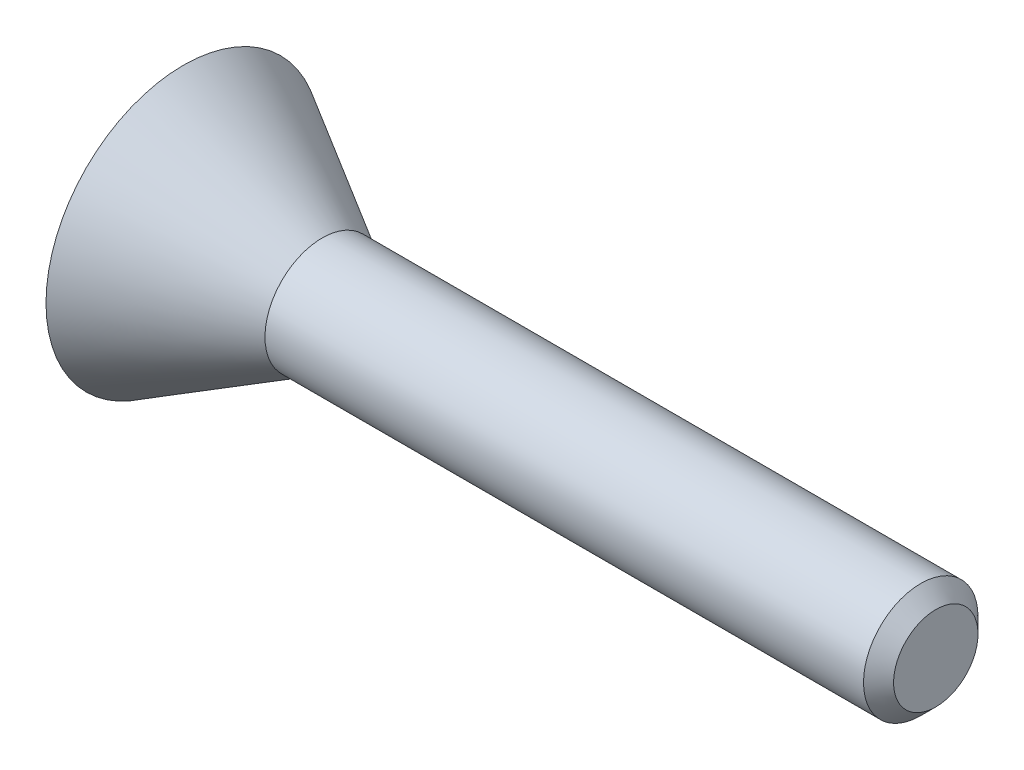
ISO-10303-21;
HEADER;
FILE_DESCRIPTION(('STEP AP214'),'2;1');
FILE_NAME('part.step','',(''),(''),'','','');
FILE_SCHEMA(('AUTOMOTIVE_DESIGN { 1 0 10303 214 1 1 1 1 }'));
ENDSEC;
DATA;
#1=APPLICATION_CONTEXT('core data for automotive mechanical design processes');
#2=APPLICATION_PROTOCOL_DEFINITION('international standard','automotive_design',2000,#1);
#3=PRODUCT_CONTEXT('',#1,'mechanical');
#4=PRODUCT('Part','Part','',(#3));
#5=PRODUCT_RELATED_PRODUCT_CATEGORY('part','',(#4));
#6=PRODUCT_DEFINITION_FORMATION('','',#4);
#7=PRODUCT_DEFINITION_CONTEXT('part definition',#1,'design');
#8=PRODUCT_DEFINITION('design','',#6,#7);
#9=PRODUCT_DEFINITION_SHAPE('','',#8);
#10=(LENGTH_UNIT() NAMED_UNIT(*) SI_UNIT(.MILLI.,.METRE.));
#11=(NAMED_UNIT(*) PLANE_ANGLE_UNIT() SI_UNIT($,.RADIAN.));
#12=(NAMED_UNIT(*) SI_UNIT($,.STERADIAN.) SOLID_ANGLE_UNIT());
#13=UNCERTAINTY_MEASURE_WITH_UNIT(LENGTH_MEASURE(1.E-05),#10,'distance_accuracy_value','');
#14=(GEOMETRIC_REPRESENTATION_CONTEXT(3) GLOBAL_UNCERTAINTY_ASSIGNED_CONTEXT((#13)) GLOBAL_UNIT_ASSIGNED_CONTEXT((#10,
#11,#12)) REPRESENTATION_CONTEXT('',''));
#15=CARTESIAN_POINT('',(0.,0.,0.));
#16=DIRECTION('',(0.,0.,1.));
#17=DIRECTION('',(1.,0.,0.));
#18=AXIS2_PLACEMENT_3D('',#15,#16,#17);
#19=CARTESIAN_POINT('',(-11.5,0.,0.));
#20=DIRECTION('',(1.,0.,0.));
#21=DIRECTION('',(0.,0.,-1.));
#22=AXIS2_PLACEMENT_3D('',#19,#20,#21);
#23=PLANE('',#22);
#24=DIRECTION('',(0.,-1.,0.));
#25=VECTOR('',#24,1.);
#26=CARTESIAN_POINT('',(-11.5,1.08953627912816,-2.69172329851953));
#27=LINE('',#26,#25);
#28=CARTESIAN_POINT('',(-11.5,1.08953627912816,-2.69172329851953));
#29=VERTEX_POINT('',#28);
#30=CARTESIAN_POINT('',(-11.5,0.725859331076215,-2.69172329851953));
#31=VERTEX_POINT('',#30);
#32=EDGE_CURVE('E298',#29,#31,#27,.T.);
#33=ORIENTED_EDGE('',*,*,#32,.F.);
#34=DIRECTION('',(0.,0.,-1.));
#35=VECTOR('',#34,1.);
#36=CARTESIAN_POINT('',(-11.5,1.08953627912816,-1.04164212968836));
#37=LINE('',#36,#35);
#38=CARTESIAN_POINT('',(-11.5,1.08953627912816,-1.04164212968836));
#39=VERTEX_POINT('',#38);
#40=EDGE_CURVE('E54',#39,#29,#37,.T.);
#41=ORIENTED_EDGE('',*,*,#40,.F.);
#42=DIRECTION('',(0.,1.,0.));
#43=VECTOR('',#42,1.);
#44=CARTESIAN_POINT('',(-11.5,0.110315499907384,-1.04164212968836));
#45=LINE('',#44,#43);
#46=CARTESIAN_POINT('',(-11.5,0.110315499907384,-1.04164212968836));
#47=VERTEX_POINT('',#46);
#48=EDGE_CURVE('E275',#47,#39,#45,.T.);
#49=ORIENTED_EDGE('',*,*,#48,.F.);
#50=DIRECTION('',(0.,0.,1.));
#51=VECTOR('',#50,1.);
#52=CARTESIAN_POINT('',(-11.5,0.110315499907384,-1.58598060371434));
#53=LINE('',#52,#51);
#54=CARTESIAN_POINT('',(-11.5,0.110315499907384,-1.58598060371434));
#55=VERTEX_POINT('',#54);
#56=EDGE_CURVE('E278',#55,#47,#53,.T.);
#57=ORIENTED_EDGE('',*,*,#56,.F.);
#58=DIRECTION('',(0.,-1.,0.));
#59=VECTOR('',#58,1.);
#60=CARTESIAN_POINT('',(-11.5,0.562263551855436,-1.58598060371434));
#61=LINE('',#60,#59);
#62=CARTESIAN_POINT('',(-11.5,0.562263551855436,-1.58598060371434));
#63=VERTEX_POINT('',#62);
#64=EDGE_CURVE('E312',#63,#55,#61,.T.);
#65=ORIENTED_EDGE('',*,*,#64,.F.);
#66=DIRECTION('',(0.,0.,1.));
#67=VECTOR('',#66,1.);
#68=CARTESIAN_POINT('',(-11.5,0.562263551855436,-2.08206420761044));
#69=LINE('',#68,#67);
#70=CARTESIAN_POINT('',(-11.5,0.562263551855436,-2.08206420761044));
#71=VERTEX_POINT('',#70);
#72=EDGE_CURVE('E309',#71,#63,#69,.T.);
#73=ORIENTED_EDGE('',*,*,#72,.F.);
#74=DIRECTION('',(0.,0.966781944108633,-0.255602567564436));
#75=VECTOR('',#74,1.);
#76=CARTESIAN_POINT('',(-11.5,-1.81046372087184,-1.45475089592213));
#77=LINE('',#76,#75);
#78=CARTESIAN_POINT('',(-11.5,-1.81046372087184,-1.45475089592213));
#79=VERTEX_POINT('',#78);
#80=EDGE_CURVE('E306',#79,#71,#77,.T.);
#81=ORIENTED_EDGE('',*,*,#80,.F.);
#82=DIRECTION('',(0.,0.,1.));
#83=VECTOR('',#82,1.);
#84=CARTESIAN_POINT('',(-11.5,-1.81046372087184,-2.0444018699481));
#85=LINE('',#84,#83);
#86=CARTESIAN_POINT('',(-11.5,-1.81046372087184,-2.0444018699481));
#87=VERTEX_POINT('',#86);
#88=EDGE_CURVE('E303',#87,#79,#85,.T.);
#89=ORIENTED_EDGE('',*,*,#88,.F.);
#90=DIRECTION('',(0.,-0.968940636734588,0.247293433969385));
#91=VECTOR('',#90,1.);
#92=CARTESIAN_POINT('',(-11.5,0.725859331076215,-2.69172329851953));
#93=LINE('',#92,#91);
#94=EDGE_CURVE('E300',#31,#87,#93,.T.);
#95=ORIENTED_EDGE('',*,*,#94,.F.);
#96=EDGE_LOOP('',(#33,#41,#49,#57,#65,#73,#81,#89,#95));
#97=FACE_BOUND('',#96,.T.);
#98=DIRECTION('',(0.,1.,0.));
#99=VECTOR('',#98,1.);
#100=CARTESIAN_POINT('',(-11.5,-1.81046372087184,2.87135705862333));
#101=LINE('',#100,#99);
#102=CARTESIAN_POINT('',(-11.5,-1.81046372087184,2.87135705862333));
#103=VERTEX_POINT('',#102);
#104=CARTESIAN_POINT('',(-11.5,-1.3173224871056,2.87135705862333));
#105=VERTEX_POINT('',#104);
#106=EDGE_CURVE('E427',#103,#105,#101,.T.);
#107=ORIENTED_EDGE('',*,*,#106,.F.);
#108=DIRECTION('',(0.,0.,1.));
#109=VECTOR('',#108,1.);
#110=CARTESIAN_POINT('',(-11.5,-1.81046372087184,1.1636054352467));
#111=LINE('',#110,#109);
#112=CARTESIAN_POINT('',(-11.5,-1.81046372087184,1.1636054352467));
#113=VERTEX_POINT('',#112);
#114=EDGE_CURVE('E62',#113,#103,#111,.T.);
#115=ORIENTED_EDGE('',*,*,#114,.F.);
#116=DIRECTION('',(0.,-1.,0.));
#117=VECTOR('',#116,1.);
#118=CARTESIAN_POINT('',(-11.5,-1.28319099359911,1.1636054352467));
#119=LINE('',#118,#117);
#120=CARTESIAN_POINT('',(-11.5,-1.28319099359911,1.1636054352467));
#121=VERTEX_POINT('',#120);
#122=EDGE_CURVE('E336',#121,#113,#119,.T.);
#123=ORIENTED_EDGE('',*,*,#122,.F.);
#124=DIRECTION('',(0.,0.,-1.));
#125=VECTOR('',#124,1.);
#126=CARTESIAN_POINT('',(-11.5,-1.28319099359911,2.15047637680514));
#127=LINE('',#126,#125);
#128=CARTESIAN_POINT('',(-11.5,-1.28319099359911,2.15047637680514));
#129=VERTEX_POINT('',#128);
#130=EDGE_CURVE('E535',#129,#121,#127,.T.);
#131=ORIENTED_EDGE('',*,*,#130,.F.);
#132=DIRECTION('',(0.,-0.786034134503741,0.618183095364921));
#133=VECTOR('',#132,1.);
#134=CARTESIAN_POINT('',(-11.5,-0.379294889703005,1.43959975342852));
#135=LINE('',#134,#133);
#136=CARTESIAN_POINT('',(-11.5,-0.379294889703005,1.43959975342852));
#137=VERTEX_POINT('',#136);
#138=EDGE_CURVE('E538',#137,#129,#135,.T.);
#139=ORIENTED_EDGE('',*,*,#138,.F.);
#140=CARTESIAN_POINT('',(-11.5,0.36689017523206,1.179494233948));
#141=CARTESIAN_POINT('',(-11.5,0.333893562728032,1.18024451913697));
#142=CARTESIAN_POINT('',(-11.5,0.267842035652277,1.18174641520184));
#143=CARTESIAN_POINT('',(-11.5,0.168986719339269,1.19530343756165));
#144=CARTESIAN_POINT('',(-11.5,0.0706361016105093,1.21715031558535));
#145=CARTESIAN_POINT('',(-11.5,-0.0267346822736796,1.24715379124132));
#146=CARTESIAN_POINT('',(-11.5,-0.121439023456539,1.2844257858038));
#147=CARTESIAN_POINT('',(-11.5,-0.212179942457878,1.32915934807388));
#148=CARTESIAN_POINT('',(-11.5,-0.298997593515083,1.37964691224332));
#149=CARTESIAN_POINT('',(-11.5,-0.352580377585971,1.4196537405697));
#150=CARTESIAN_POINT('',(-11.5,-0.379294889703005,1.43959975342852));
#151=B_SPLINE_CURVE_WITH_KNOTS('',3,(#140,#141,#142,#143,#144,#145,#146,#147,#148,#149,#150),
.UNSPECIFIED.,.F.,.F.,(4,1,1,1,1,1,1,1,4),(0.,0.123046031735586,0.246309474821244,
0.371480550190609,0.498560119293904,0.626024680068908,0.750715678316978,0.875715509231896,1.),.UNSPECIFIED.);
#152=CARTESIAN_POINT('',(-11.5,0.366890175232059,1.179494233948));
#153=VERTEX_POINT('',#152);
#154=EDGE_CURVE('E541',#153,#137,#151,.T.);
#155=ORIENTED_EDGE('',*,*,#154,.F.);
#156=DIRECTION('',(0.,-1.,0.));
#157=VECTOR('',#156,1.);
#158=CARTESIAN_POINT('',(-11.5,0.369244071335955,1.179494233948));
#159=LINE('',#158,#157);
#160=CARTESIAN_POINT('',(-11.5,0.369244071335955,1.179494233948));
#161=VERTEX_POINT('',#160);
#162=EDGE_CURVE('E546',#161,#153,#159,.T.);
#163=ORIENTED_EDGE('',*,*,#162,.F.);
#164=CARTESIAN_POINT('',(-11.5,1.1271986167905,2.03337004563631));
#165=CARTESIAN_POINT('',(-11.5,1.12673011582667,2.00038890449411));
#166=CARTESIAN_POINT('',(-11.5,1.12581894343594,1.93624494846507));
#167=CARTESIAN_POINT('',(-11.5,1.11598311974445,1.8428624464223));
#168=CARTESIAN_POINT('',(-11.5,1.10113799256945,1.75499941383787));
#169=CARTESIAN_POINT('',(-11.5,1.07942028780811,1.67279723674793));
#170=CARTESIAN_POINT('',(-11.5,1.05109146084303,1.59658592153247));
#171=CARTESIAN_POINT('',(-11.5,1.01693387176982,1.52613716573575));
#172=CARTESIAN_POINT('',(-11.5,0.976656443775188,1.46130370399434));
#173=CARTESIAN_POINT('',(-11.5,0.930173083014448,1.40258205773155));
#174=CARTESIAN_POINT('',(-11.5,0.878328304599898,1.34974708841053));
#175=CARTESIAN_POINT('',(-11.5,0.820595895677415,1.30427043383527));
#176=CARTESIAN_POINT('',(-11.5,0.758142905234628,1.26490285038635));
#177=CARTESIAN_POINT('',(-11.5,0.689758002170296,1.23412948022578));
#178=CARTESIAN_POINT('',(-11.5,0.61704935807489,1.2087943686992));
#179=CARTESIAN_POINT('',(-11.5,0.538713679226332,1.19239027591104));
#180=CARTESIAN_POINT('',(-11.5,0.455673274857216,1.1813360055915));
#181=CARTESIAN_POINT('',(-11.5,0.398510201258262,1.18011788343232));
#182=CARTESIAN_POINT('',(-11.5,0.369244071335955,1.179494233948));
#183=B_SPLINE_CURVE_WITH_KNOTS('',3,(#164,#165,#166,#167,#168,#169,#170,#171,#172,#173,#174,
#175,#176,#177,#178,#179,#180,#181,#182),.UNSPECIFIED.,.F.,.F.,(4,1,1,1,1,1,1,1,1,1,1,1,1,1,1,1,
4),(0.,0.0762312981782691,0.148259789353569,0.216860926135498,0.28210063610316,
0.344528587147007,0.404571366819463,0.462840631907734,0.520642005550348,0.577409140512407,
0.633580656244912,0.690215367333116,0.747647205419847,0.806597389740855,0.867894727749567,
0.932365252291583,1.),.UNSPECIFIED.);
#184=CARTESIAN_POINT('',(-11.5,1.1271986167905,2.03337004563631));
#185=VERTEX_POINT('',#184);
#186=EDGE_CURVE('E552',#185,#161,#183,.T.);
#187=ORIENTED_EDGE('',*,*,#186,.F.);
#188=CARTESIAN_POINT('',(-11.5,0.256845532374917,2.90725397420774));
#189=CARTESIAN_POINT('',(-11.5,0.290460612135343,2.90450121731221));
#190=CARTESIAN_POINT('',(-11.5,0.356076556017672,2.89912789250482));
#191=CARTESIAN_POINT('',(-11.5,0.450993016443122,2.88151179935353));
#192=CARTESIAN_POINT('',(-11.5,0.540397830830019,2.85874369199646));
#193=CARTESIAN_POINT('',(-11.5,0.624273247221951,2.82977959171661));
#194=CARTESIAN_POINT('',(-11.5,0.701648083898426,2.79256061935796));
#195=CARTESIAN_POINT('',(-11.5,0.774139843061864,2.75074397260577));
#196=CARTESIAN_POINT('',(-11.5,0.839506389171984,2.70044902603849));
#197=CARTESIAN_POINT('',(-11.5,0.899935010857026,2.64539415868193));
#198=CARTESIAN_POINT('',(-11.5,0.953159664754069,2.58407288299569));
#199=CARTESIAN_POINT('',(-11.5,1.0001109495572,2.51868755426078));
#200=CARTESIAN_POINT('',(-11.5,1.03918202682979,2.44824944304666));
#201=CARTESIAN_POINT('',(-11.5,1.07159379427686,2.37382939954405));
#202=CARTESIAN_POINT('',(-11.5,1.09619340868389,2.29460231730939));
#203=CARTESIAN_POINT('',(-11.5,1.11462039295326,2.21160309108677));
#204=CARTESIAN_POINT('',(-11.5,1.12524728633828,2.12387904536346));
#205=CARTESIAN_POINT('',(-11.5,1.12653826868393,2.06399912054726));
#206=CARTESIAN_POINT('',(-11.5,1.1271986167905,2.03337004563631));
#207=B_SPLINE_CURVE_WITH_KNOTS('',3,(#188,#189,#190,#191,#192,#193,#194,#195,#196,#197,#198,
#199,#200,#201,#202,#203,#204,#205,#206),.UNSPECIFIED.,.F.,.F.,(4,1,1,1,1,1,1,1,1,1,1,1,1,1,1,1,
4),(0.,0.0733268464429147,0.14313249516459,0.209679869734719,0.273918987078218,0.33576228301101,
0.396210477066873,0.45560885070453,0.514796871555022,0.573764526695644,0.631900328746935,
0.689592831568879,0.748648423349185,0.808163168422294,0.869766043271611,0.933384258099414,1.),.UNSPECIFIED.);
#208=CARTESIAN_POINT('',(-11.5,0.256845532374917,2.90725397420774));
#209=VERTEX_POINT('',#208);
#210=EDGE_CURVE('E557',#209,#185,#207,.T.);
#211=ORIENTED_EDGE('',*,*,#210,.F.);
#212=DIRECTION('',(0.,1.,0.));
#213=VECTOR('',#212,1.);
#214=CARTESIAN_POINT('',(-11.5,0.255080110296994,2.90725397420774));
#215=LINE('',#214,#213);
#216=CARTESIAN_POINT('',(-11.5,0.255080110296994,2.90725397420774));
#217=VERTEX_POINT('',#216);
#218=EDGE_CURVE('E565',#217,#209,#215,.T.);
#219=ORIENTED_EDGE('',*,*,#218,.F.);
#220=DIRECTION('',(0.,0.,1.));
#221=VECTOR('',#220,1.);
#222=CARTESIAN_POINT('',(-11.5,0.255080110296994,2.34938059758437));
#223=LINE('',#222,#221);
#224=CARTESIAN_POINT('',(-11.5,0.255080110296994,2.34938059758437));
#225=VERTEX_POINT('',#224);
#226=EDGE_CURVE('E571',#225,#217,#223,.T.);
#227=ORIENTED_EDGE('',*,*,#226,.F.);
#228=DIRECTION('',(0.,-1.,0.));
#229=VECTOR('',#228,1.);
#230=CARTESIAN_POINT('',(-11.5,0.256845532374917,2.34938059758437));
#231=LINE('',#230,#229);
#232=CARTESIAN_POINT('',(-11.5,0.256845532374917,2.34938059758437));
#233=VERTEX_POINT('',#232);
#234=EDGE_CURVE('E574',#233,#225,#231,.T.);
#235=ORIENTED_EDGE('',*,*,#234,.F.);
#236=CARTESIAN_POINT('',(-11.5,0.599925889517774,2.0292507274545));
#237=CARTESIAN_POINT('',(-11.5,0.599094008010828,2.050569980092));
#238=CARTESIAN_POINT('',(-11.5,0.597477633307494,2.09199402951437));
#239=CARTESIAN_POINT('',(-11.5,0.579563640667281,2.15063683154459));
#240=CARTESIAN_POINT('',(-11.5,0.5514642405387,2.20347971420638));
#241=CARTESIAN_POINT('',(-11.5,0.511369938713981,2.24903447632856));
#242=CARTESIAN_POINT('',(-11.5,0.461030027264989,2.28675727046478));
#243=CARTESIAN_POINT('',(-11.5,0.401750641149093,2.3173729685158));
#244=CARTESIAN_POINT('',(-11.5,0.332461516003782,2.3381669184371));
#245=CARTESIAN_POINT('',(-11.5,0.282861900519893,2.34552242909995));
#246=CARTESIAN_POINT('',(-11.5,0.256845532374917,2.34938059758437));
#247=B_SPLINE_CURVE_WITH_KNOTS('',3,(#236,#237,#238,#239,#240,#241,#242,#243,#244,#245,#246),
.UNSPECIFIED.,.F.,.F.,(4,1,1,1,1,1,1,1,4),(0.,0.122603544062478,0.238222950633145,
0.350089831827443,0.465559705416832,0.58502806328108,0.711014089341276,0.848418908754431,1.),.UNSPECIFIED.);
#248=CARTESIAN_POINT('',(-11.5,0.599925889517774,2.0292507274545));
#249=VERTEX_POINT('',#248);
#250=EDGE_CURVE('E577',#249,#233,#247,.T.);
#251=ORIENTED_EDGE('',*,*,#250,.F.);
#252=CARTESIAN_POINT('',(-11.5,0.353943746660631,1.73972150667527));
#253=CARTESIAN_POINT('',(-11.5,0.372486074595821,1.74052539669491));
#254=CARTESIAN_POINT('',(-11.5,0.408010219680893,1.74206552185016));
#255=CARTESIAN_POINT('',(-11.5,0.458064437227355,1.75657591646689));
#256=CARTESIAN_POINT('',(-11.5,0.501654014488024,1.78035767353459));
#257=CARTESIAN_POINT('',(-11.5,0.537658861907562,1.81441889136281));
#258=CARTESIAN_POINT('',(-11.5,0.566136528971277,1.85682250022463));
#259=CARTESIAN_POINT('',(-11.5,0.586205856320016,1.90755959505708));
#260=CARTESIAN_POINT('',(-11.5,0.597714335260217,1.96596632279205));
#261=CARTESIAN_POINT('',(-11.5,0.599163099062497,2.00742320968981));
#262=CARTESIAN_POINT('',(-11.5,0.599925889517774,2.0292507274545));
#263=B_SPLINE_CURVE_WITH_KNOTS('',3,(#252,#253,#254,#255,#256,#257,#258,#259,#260,#261,#262),
.UNSPECIFIED.,.F.,.F.,(4,1,1,1,1,1,1,1,4),(0.,0.128749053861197,0.246662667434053,
0.359069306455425,0.47107757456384,0.588039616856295,0.711712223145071,0.848213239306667,1.),.UNSPECIFIED.);
#264=CARTESIAN_POINT('',(-11.5,0.353943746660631,1.73972150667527));
#265=VERTEX_POINT('',#264);
#266=EDGE_CURVE('E582',#265,#249,#263,.T.);
#267=ORIENTED_EDGE('',*,*,#266,.F.);
#268=DIRECTION('',(0.,1.,0.));
#269=VECTOR('',#268,1.);
#270=CARTESIAN_POINT('',(-11.5,0.349824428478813,1.73972150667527));
#271=LINE('',#270,#269);
#272=CARTESIAN_POINT('',(-11.5,0.349824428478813,1.73972150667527));
#273=VERTEX_POINT('',#272);
#274=EDGE_CURVE('E590',#273,#265,#271,.T.);
#275=ORIENTED_EDGE('',*,*,#274,.F.);
#276=CARTESIAN_POINT('',(-11.5,-0.00443693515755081,1.88036679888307));
#277=CARTESIAN_POINT('',(-11.5,0.0248100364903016,1.85961033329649));
#278=CARTESIAN_POINT('',(-11.5,0.0817968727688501,1.81916699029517));
#279=CARTESIAN_POINT('',(-11.5,0.160056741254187,1.78256264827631));
#280=CARTESIAN_POINT('',(-11.5,0.221413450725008,1.75975965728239));
#281=CARTESIAN_POINT('',(-11.5,0.265909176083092,1.74889225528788));
#282=CARTESIAN_POINT('',(-11.5,0.308362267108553,1.74113978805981));
#283=CARTESIAN_POINT('',(-11.5,0.336257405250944,1.74018558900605));
#284=CARTESIAN_POINT('',(-11.5,0.349824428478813,1.73972150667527));
#285=B_SPLINE_CURVE_WITH_KNOTS('',3,(#276,#277,#278,#279,#280,#281,#282,#283,#284),
.UNSPECIFIED.,.F.,.F.,(4,1,1,1,1,1,4),(0.,0.27737542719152,0.540457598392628,0.666416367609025,
0.784009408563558,0.894951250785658,1.),.UNSPECIFIED.);
#286=CARTESIAN_POINT('',(-11.5,-0.00443693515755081,1.88036679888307));
#287=VERTEX_POINT('',#286);
#288=EDGE_CURVE('E596',#287,#273,#285,.T.);
#289=ORIENTED_EDGE('',*,*,#288,.F.);
#290=DIRECTION('',(0.,0.798150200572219,-0.602458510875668));
#291=VECTOR('',#290,1.);
#292=CARTESIAN_POINT('',(-11.5,-1.3173224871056,2.87135705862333));
#293=LINE('',#292,#291);
#294=EDGE_CURVE('E601',#105,#287,#293,.T.);
#295=ORIENTED_EDGE('',*,*,#294,.F.);
#296=EDGE_LOOP('',(#107,#115,#123,#131,#139,#155,#163,#187,#211,#219,#227,#235,#251,#267,#275,
#289,#295));
#297=FACE_BOUND('',#296,.T.);
#298=DIRECTION('',(0.,1.,0.));
#299=VECTOR('',#298,1.);
#300=CARTESIAN_POINT('',(-11.5,1.85,0.42));
#301=LINE('',#300,#299);
#302=CARTESIAN_POINT('',(-11.5,-2.77,0.42));
#303=VERTEX_POINT('',#302);
#304=CARTESIAN_POINT('',(-11.5,1.85,0.42));
#305=VERTEX_POINT('',#304);
#306=EDGE_CURVE('E433',#303,#305,#301,.T.);
#307=ORIENTED_EDGE('',*,*,#306,.F.);
#308=CARTESIAN_POINT('',(-11.5,-2.77,0.));
#309=DIRECTION('',(-1.,0.,0.));
#310=DIRECTION('',(0.,0.,1.));
#311=AXIS2_PLACEMENT_3D('',#308,#309,#310);
#312=CIRCLE('',#311,0.42);
#313=CARTESIAN_POINT('',(-11.5,-2.77,-0.419999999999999));
#314=VERTEX_POINT('',#313);
#315=EDGE_CURVE('E477',#314,#303,#312,.T.);
#316=ORIENTED_EDGE('',*,*,#315,.F.);
#317=DIRECTION('',(0.,-1.,0.));
#318=VECTOR('',#317,1.);
#319=CARTESIAN_POINT('',(-11.5,1.85,-0.42));
#320=LINE('',#319,#318);
#321=CARTESIAN_POINT('',(-11.5,1.85,-0.42));
#322=VERTEX_POINT('',#321);
#323=EDGE_CURVE('E460',#322,#314,#320,.T.);
#324=ORIENTED_EDGE('',*,*,#323,.F.);
#325=DIRECTION('',(0.,0.,1.));
#326=VECTOR('',#325,1.);
#327=CARTESIAN_POINT('',(-11.5,1.85,-1.01));
#328=LINE('',#327,#326);
#329=CARTESIAN_POINT('',(-11.5,1.85,-1.01));
#330=VERTEX_POINT('',#329);
#331=EDGE_CURVE('E464',#330,#322,#328,.T.);
#332=ORIENTED_EDGE('',*,*,#331,.F.);
#333=DIRECTION('',(0.,-0.857042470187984,-0.515245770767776));
#334=VECTOR('',#333,1.);
#335=CARTESIAN_POINT('',(-11.5,3.53,0.));
#336=LINE('',#335,#334);
#337=CARTESIAN_POINT('',(-11.5,3.53,0.));
#338=VERTEX_POINT('',#337);
#339=EDGE_CURVE('E467',#338,#330,#336,.T.);
#340=ORIENTED_EDGE('',*,*,#339,.F.);
#341=DIRECTION('',(0.,0.857042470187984,-0.515245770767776));
#342=VECTOR('',#341,1.);
#343=CARTESIAN_POINT('',(-11.5,3.53,0.));
#344=LINE('',#343,#342);
#345=CARTESIAN_POINT('',(-11.5,1.85,1.01));
#346=VERTEX_POINT('',#345);
#347=EDGE_CURVE('E470',#346,#338,#344,.T.);
#348=ORIENTED_EDGE('',*,*,#347,.F.);
#349=DIRECTION('',(0.,0.,1.));
#350=VECTOR('',#349,1.);
#351=CARTESIAN_POINT('',(-11.5,1.85,1.01));
#352=LINE('',#351,#350);
#353=EDGE_CURVE('E473',#305,#346,#352,.T.);
#354=ORIENTED_EDGE('',*,*,#353,.F.);
#355=EDGE_LOOP('',(#307,#316,#324,#332,#340,#348,#354));
#356=FACE_BOUND('',#355,.T.);
#357=CARTESIAN_POINT('',(-11.5,0.,0.));
#358=DIRECTION('',(-1.,0.,0.));
#359=DIRECTION('',(0.,-1.,0.));
#360=AXIS2_PLACEMENT_3D('',#357,#358,#359);
#361=CIRCLE('',#360,4.2);
#362=CARTESIAN_POINT('',(-11.5,-4.2,0.));
#363=VERTEX_POINT('',#362);
#364=EDGE_CURVE('E436',#363,#363,#361,.T.);
#365=ORIENTED_EDGE('',*,*,#364,.T.);
#366=EDGE_LOOP('',(#365));
#367=FACE_BOUND('',#366,.T.);
#368=ADVANCED_FACE('F39',(#97,#297,#356,#367),#23,.F.);
#369=CARTESIAN_POINT('',(-11.5,0.,0.));
#370=DIRECTION('',(-1.,0.,0.));
#371=DIRECTION('',(0.,-1.,0.));
#372=AXIS2_PLACEMENT_3D('',#369,#370,#371);
#373=CONICAL_SURFACE('',#372,4.2,0.523598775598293);
#374=CARTESIAN_POINT('',(-7.25647552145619,0.,0.));
#375=DIRECTION('',(-1.,0.,0.));
#376=DIRECTION('',(0.,-1.,0.));
#377=AXIS2_PLACEMENT_3D('',#374,#375,#376);
#378=CIRCLE('',#377,1.75);
#379=CARTESIAN_POINT('',(-7.25647552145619,-1.75,0.));
#380=VERTEX_POINT('',#379);
#381=EDGE_CURVE('E438',#380,#380,#378,.T.);
#382=ORIENTED_EDGE('',*,*,#381,.T.);
#383=EDGE_LOOP('',(#382));
#384=FACE_BOUND('',#383,.T.);
#385=ORIENTED_EDGE('',*,*,#364,.F.);
#386=EDGE_LOOP('',(#385));
#387=FACE_BOUND('',#386,.T.);
#388=ADVANCED_FACE('F410',(#384,#387),#373,.T.);
#389=CARTESIAN_POINT('',(-11.5,0.,0.));
#390=DIRECTION('',(-1.,0.,0.));
#391=DIRECTION('',(0.,-1.,0.));
#392=AXIS2_PLACEMENT_3D('',#389,#390,#391);
#393=CYLINDRICAL_SURFACE('',#392,1.75);
#394=CARTESIAN_POINT('',(11.04,0.,0.));
#395=DIRECTION('',(1.,0.,0.));
#396=DIRECTION('',(0.,1.,0.));
#397=AXIS2_PLACEMENT_3D('',#394,#395,#396);
#398=CIRCLE('',#397,1.75);
#399=CARTESIAN_POINT('',(11.04,1.75,0.));
#400=VERTEX_POINT('',#399);
#401=EDGE_CURVE('E47',#400,#400,#398,.F.);
#402=ORIENTED_EDGE('',*,*,#401,.T.);
#403=EDGE_LOOP('',(#402));
#404=FACE_BOUND('',#403,.T.);
#405=ORIENTED_EDGE('',*,*,#381,.F.);
#406=EDGE_LOOP('',(#405));
#407=FACE_BOUND('',#406,.T.);
#408=ADVANCED_FACE('F407',(#404,#407),#393,.T.);
#409=CARTESIAN_POINT('',(11.5,0.,0.));
#410=DIRECTION('',(1.,0.,0.));
#411=DIRECTION('',(0.,0.,-1.));
#412=AXIS2_PLACEMENT_3D('',#409,#410,#411);
#413=PLANE('',#412);
#414=CARTESIAN_POINT('',(11.5,0.,0.));
#415=DIRECTION('',(1.,0.,0.));
#416=DIRECTION('',(0.,0.,-1.));
#417=AXIS2_PLACEMENT_3D('',#414,#415,#416);
#418=CIRCLE('',#417,1.29);
#419=CARTESIAN_POINT('',(11.5,0.,-1.29));
#420=VERTEX_POINT('',#419);
#421=EDGE_CURVE('E11',#420,#420,#418,.T.);
#422=ORIENTED_EDGE('',*,*,#421,.T.);
#423=EDGE_LOOP('',(#422));
#424=FACE_BOUND('',#423,.T.);
#425=ADVANCED_FACE('F405',(#424),#413,.T.);
#426=CARTESIAN_POINT('',(-10.9,-2.77,0.));
#427=DIRECTION('',(-1.,0.,0.));
#428=DIRECTION('',(0.,0.,1.));
#429=AXIS2_PLACEMENT_3D('',#426,#427,#428);
#430=CYLINDRICAL_SURFACE('',#429,0.42);
#431=ORIENTED_EDGE('',*,*,#315,.T.);
#432=DIRECTION('',(-1.,0.,0.));
#433=VECTOR('',#432,1.);
#434=CARTESIAN_POINT('',(-10.9,-2.77,0.42));
#435=LINE('',#434,#433);
#436=CARTESIAN_POINT('',(-10.9,-2.77,0.42));
#437=VERTEX_POINT('',#436);
#438=EDGE_CURVE('E445',#437,#303,#435,.T.);
#439=ORIENTED_EDGE('',*,*,#438,.F.);
#440=CARTESIAN_POINT('',(-10.9,-2.77,0.));
#441=DIRECTION('',(-1.,0.,0.));
#442=DIRECTION('',(0.,0.,1.));
#443=AXIS2_PLACEMENT_3D('',#440,#441,#442);
#444=CIRCLE('',#443,0.42);
#445=CARTESIAN_POINT('',(-10.9,-2.77,-0.419999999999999));
#446=VERTEX_POINT('',#445);
#447=EDGE_CURVE('E463',#446,#437,#444,.T.);
#448=ORIENTED_EDGE('',*,*,#447,.F.);
#449=DIRECTION('',(-1.,0.,0.));
#450=VECTOR('',#449,1.);
#451=CARTESIAN_POINT('',(-10.9,-2.77,-0.419999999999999));
#452=LINE('',#451,#450);
#453=EDGE_CURVE('E442',#446,#314,#452,.T.);
#454=ORIENTED_EDGE('',*,*,#453,.T.);
#455=EDGE_LOOP('',(#431,#439,#448,#454));
#456=FACE_BOUND('',#455,.T.);
#457=ADVANCED_FACE('F383',(#456),#430,.F.);
#458=CARTESIAN_POINT('',(-10.9,1.85,-0.42));
#459=DIRECTION('',(0.,0.,-1.));
#460=DIRECTION('',(0.,1.,0.));
#461=AXIS2_PLACEMENT_3D('',#458,#459,#460);
#462=PLANE('',#461);
#463=ORIENTED_EDGE('',*,*,#323,.T.);
#464=ORIENTED_EDGE('',*,*,#453,.F.);
#465=DIRECTION('',(0.,-1.,0.));
#466=VECTOR('',#465,1.);
#467=CARTESIAN_POINT('',(-10.9,1.85,-0.42));
#468=LINE('',#467,#466);
#469=CARTESIAN_POINT('',(-10.9,1.85,-0.42));
#470=VERTEX_POINT('',#469);
#471=EDGE_CURVE('E449',#470,#446,#468,.T.);
#472=ORIENTED_EDGE('',*,*,#471,.F.);
#473=DIRECTION('',(-1.,0.,0.));
#474=VECTOR('',#473,1.);
#475=CARTESIAN_POINT('',(-10.9,1.85,-0.42));
#476=LINE('',#475,#474);
#477=EDGE_CURVE('E457',#470,#322,#476,.T.);
#478=ORIENTED_EDGE('',*,*,#477,.T.);
#479=EDGE_LOOP('',(#463,#464,#472,#478));
#480=FACE_BOUND('',#479,.T.);
#481=ADVANCED_FACE('F379',(#480),#462,.F.);
#482=CARTESIAN_POINT('',(-10.9,1.85,-1.01));
#483=DIRECTION('',(0.,-1.,0.));
#484=DIRECTION('',(0.,0.,-1.));
#485=AXIS2_PLACEMENT_3D('',#482,#483,#484);
#486=PLANE('',#485);
#487=ORIENTED_EDGE('',*,*,#331,.T.);
#488=ORIENTED_EDGE('',*,*,#477,.F.);
#489=DIRECTION('',(0.,0.,1.));
#490=VECTOR('',#489,1.);
#491=CARTESIAN_POINT('',(-10.9,1.85,-1.01));
#492=LINE('',#491,#490);
#493=CARTESIAN_POINT('',(-10.9,1.85,-1.01));
#494=VERTEX_POINT('',#493);
#495=EDGE_CURVE('E482',#494,#470,#492,.T.);
#496=ORIENTED_EDGE('',*,*,#495,.F.);
#497=DIRECTION('',(-1.,0.,0.));
#498=VECTOR('',#497,1.);
#499=CARTESIAN_POINT('',(-10.9,1.85,-1.01));
#500=LINE('',#499,#498);
#501=EDGE_CURVE('E455',#494,#330,#500,.T.);
#502=ORIENTED_EDGE('',*,*,#501,.T.);
#503=EDGE_LOOP('',(#487,#488,#496,#502));
#504=FACE_BOUND('',#503,.T.);
#505=ADVANCED_FACE('F382',(#504),#486,.F.);
#506=CARTESIAN_POINT('',(-10.9,3.53,0.));
#507=DIRECTION('',(0.,0.515245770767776,-0.857042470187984));
#508=DIRECTION('',(0.,0.857042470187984,0.515245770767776));
#509=AXIS2_PLACEMENT_3D('',#506,#507,#508);
#510=PLANE('',#509);
#511=ORIENTED_EDGE('',*,*,#339,.T.);
#512=ORIENTED_EDGE('',*,*,#501,.F.);
#513=DIRECTION('',(0.,-0.857042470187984,-0.515245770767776));
#514=VECTOR('',#513,1.);
#515=CARTESIAN_POINT('',(-10.9,3.53,0.));
#516=LINE('',#515,#514);
#517=CARTESIAN_POINT('',(-10.9,3.53,0.));
#518=VERTEX_POINT('',#517);
#519=EDGE_CURVE('E485',#518,#494,#516,.T.);
#520=ORIENTED_EDGE('',*,*,#519,.F.);
#521=DIRECTION('',(-1.,0.,0.));
#522=VECTOR('',#521,1.);
#523=CARTESIAN_POINT('',(-10.9,3.53,0.));
#524=LINE('',#523,#522);
#525=EDGE_CURVE('E453',#518,#338,#524,.T.);
#526=ORIENTED_EDGE('',*,*,#525,.T.);
#527=EDGE_LOOP('',(#511,#512,#520,#526));
#528=FACE_BOUND('',#527,.T.);
#529=ADVANCED_FACE('F387',(#528),#510,.F.);
#530=CARTESIAN_POINT('',(-10.9,3.53,0.));
#531=DIRECTION('',(0.,0.515245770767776,0.857042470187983));
#532=DIRECTION('',(0.,-0.857042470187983,0.515245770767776));
#533=AXIS2_PLACEMENT_3D('',#530,#531,#532);
#534=PLANE('',#533);
#535=ORIENTED_EDGE('',*,*,#347,.T.);
#536=ORIENTED_EDGE('',*,*,#525,.F.);
#537=DIRECTION('',(0.,0.857042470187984,-0.515245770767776));
#538=VECTOR('',#537,1.);
#539=CARTESIAN_POINT('',(-10.9,3.53,0.));
#540=LINE('',#539,#538);
#541=CARTESIAN_POINT('',(-10.9,1.85,1.01));
#542=VERTEX_POINT('',#541);
#543=EDGE_CURVE('E488',#542,#518,#540,.T.);
#544=ORIENTED_EDGE('',*,*,#543,.F.);
#545=DIRECTION('',(-1.,0.,0.));
#546=VECTOR('',#545,1.);
#547=CARTESIAN_POINT('',(-10.9,1.85,1.01));
#548=LINE('',#547,#546);
#549=EDGE_CURVE('E451',#542,#346,#548,.T.);
#550=ORIENTED_EDGE('',*,*,#549,.T.);
#551=EDGE_LOOP('',(#535,#536,#544,#550));
#552=FACE_BOUND('',#551,.T.);
#553=ADVANCED_FACE('F391',(#552),#534,.F.);
#554=CARTESIAN_POINT('',(-10.9,1.85,1.01));
#555=DIRECTION('',(0.,-1.,0.));
#556=DIRECTION('',(0.,0.,-1.));
#557=AXIS2_PLACEMENT_3D('',#554,#555,#556);
#558=PLANE('',#557);
#559=ORIENTED_EDGE('',*,*,#353,.T.);
#560=ORIENTED_EDGE('',*,*,#549,.F.);
#561=DIRECTION('',(0.,0.,1.));
#562=VECTOR('',#561,1.);
#563=CARTESIAN_POINT('',(-10.9,1.85,1.01));
#564=LINE('',#563,#562);
#565=CARTESIAN_POINT('',(-10.9,1.85,0.42));
#566=VERTEX_POINT('',#565);
#567=EDGE_CURVE('E491',#566,#542,#564,.T.);
#568=ORIENTED_EDGE('',*,*,#567,.F.);
#569=DIRECTION('',(-1.,0.,0.));
#570=VECTOR('',#569,1.);
#571=CARTESIAN_POINT('',(-10.9,1.85,0.42));
#572=LINE('',#571,#570);
#573=EDGE_CURVE('E448',#566,#305,#572,.T.);
#574=ORIENTED_EDGE('',*,*,#573,.T.);
#575=EDGE_LOOP('',(#559,#560,#568,#574));
#576=FACE_BOUND('',#575,.T.);
#577=ADVANCED_FACE('F395',(#576),#558,.F.);
#578=CARTESIAN_POINT('',(-10.9,1.85,0.42));
#579=DIRECTION('',(0.,0.,1.));
#580=DIRECTION('',(0.,-1.,0.));
#581=AXIS2_PLACEMENT_3D('',#578,#579,#580);
#582=PLANE('',#581);
#583=ORIENTED_EDGE('',*,*,#306,.T.);
#584=ORIENTED_EDGE('',*,*,#573,.F.);
#585=DIRECTION('',(0.,1.,0.));
#586=VECTOR('',#585,1.);
#587=CARTESIAN_POINT('',(-10.9,1.85,0.42));
#588=LINE('',#587,#586);
#589=EDGE_CURVE('E494',#437,#566,#588,.T.);
#590=ORIENTED_EDGE('',*,*,#589,.F.);
#591=ORIENTED_EDGE('',*,*,#438,.T.);
#592=EDGE_LOOP('',(#583,#584,#590,#591));
#593=FACE_BOUND('',#592,.T.);
#594=ADVANCED_FACE('F377',(#593),#582,.F.);
#595=CARTESIAN_POINT('',(-10.9,-2.77,0.));
#596=DIRECTION('',(-1.,0.,0.));
#597=DIRECTION('',(0.,0.,1.));
#598=AXIS2_PLACEMENT_3D('',#595,#596,#597);
#599=PLANE('',#598);
#600=ORIENTED_EDGE('',*,*,#447,.T.);
#601=ORIENTED_EDGE('',*,*,#589,.T.);
#602=ORIENTED_EDGE('',*,*,#567,.T.);
#603=ORIENTED_EDGE('',*,*,#543,.T.);
#604=ORIENTED_EDGE('',*,*,#519,.T.);
#605=ORIENTED_EDGE('',*,*,#495,.T.);
#606=ORIENTED_EDGE('',*,*,#471,.T.);
#607=EDGE_LOOP('',(#600,#601,#602,#603,#604,#605,#606));
#608=FACE_BOUND('',#607,.T.);
#609=ADVANCED_FACE('F374',(#608),#599,.T.);
#610=CARTESIAN_POINT('',(11.04,0.,0.));
#611=DIRECTION('',(-1.,0.,0.));
#612=DIRECTION('',(0.,-1.,0.));
#613=AXIS2_PLACEMENT_3D('',#610,#611,#612);
#614=CONICAL_SURFACE('',#613,1.75,0.78539816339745);
#615=ORIENTED_EDGE('',*,*,#421,.F.);
#616=EDGE_LOOP('',(#615));
#617=FACE_BOUND('',#616,.T.);
#618=ORIENTED_EDGE('',*,*,#401,.F.);
#619=EDGE_LOOP('',(#618));
#620=FACE_BOUND('',#619,.T.);
#621=ADVANCED_FACE('F41',(#617,#620),#614,.T.);
#622=CARTESIAN_POINT('',(-10.9,-1.81046372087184,1.1636054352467));
#623=DIRECTION('',(0.,-1.,0.));
#624=DIRECTION('',(0.,0.,-1.));
#625=AXIS2_PLACEMENT_3D('',#622,#623,#624);
#626=PLANE('',#625);
#627=ORIENTED_EDGE('',*,*,#114,.T.);
#628=DIRECTION('',(-1.,0.,0.));
#629=VECTOR('',#628,1.);
#630=CARTESIAN_POINT('',(-10.9,-1.81046372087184,2.87135705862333));
#631=LINE('',#630,#629);
#632=CARTESIAN_POINT('',(-10.9,-1.81046372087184,2.87135705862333));
#633=VERTEX_POINT('',#632);
#634=EDGE_CURVE('E499',#633,#103,#631,.T.);
#635=ORIENTED_EDGE('',*,*,#634,.F.);
#636=DIRECTION('',(0.,0.,1.));
#637=VECTOR('',#636,1.);
#638=CARTESIAN_POINT('',(-10.9,-1.81046372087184,1.1636054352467));
#639=LINE('',#638,#637);
#640=CARTESIAN_POINT('',(-10.9,-1.81046372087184,1.1636054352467));
#641=VERTEX_POINT('',#640);
#642=EDGE_CURVE('E332',#641,#633,#639,.T.);
#643=ORIENTED_EDGE('',*,*,#642,.F.);
#644=DIRECTION('',(-1.,0.,0.));
#645=VECTOR('',#644,1.);
#646=CARTESIAN_POINT('',(-10.9,-1.81046372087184,1.1636054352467));
#647=LINE('',#646,#645);
#648=EDGE_CURVE('E479',#641,#113,#647,.T.);
#649=ORIENTED_EDGE('',*,*,#648,.T.);
#650=EDGE_LOOP('',(#627,#635,#643,#649));
#651=FACE_BOUND('',#650,.T.);
#652=ADVANCED_FACE('F370',(#651),#626,.F.);
#653=CARTESIAN_POINT('',(-10.9,-1.28319099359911,1.1636054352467));
#654=DIRECTION('',(0.,0.,-1.));
#655=DIRECTION('',(-1.,0.,0.));
#656=AXIS2_PLACEMENT_3D('',#653,#654,#655);
#657=PLANE('',#656);
#658=ORIENTED_EDGE('',*,*,#122,.T.);
#659=ORIENTED_EDGE('',*,*,#648,.F.);
#660=DIRECTION('',(0.,-1.,0.));
#661=VECTOR('',#660,1.);
#662=CARTESIAN_POINT('',(-10.9,-1.28319099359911,1.1636054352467));
#663=LINE('',#662,#661);
#664=CARTESIAN_POINT('',(-10.9,-1.28319099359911,1.1636054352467));
#665=VERTEX_POINT('',#664);
#666=EDGE_CURVE('E502',#665,#641,#663,.T.);
#667=ORIENTED_EDGE('',*,*,#666,.F.);
#668=DIRECTION('',(-1.,0.,0.));
#669=VECTOR('',#668,1.);
#670=CARTESIAN_POINT('',(-10.9,-1.28319099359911,1.1636054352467));
#671=LINE('',#670,#669);
#672=EDGE_CURVE('E530',#665,#121,#671,.T.);
#673=ORIENTED_EDGE('',*,*,#672,.T.);
#674=EDGE_LOOP('',(#658,#659,#667,#673));
#675=FACE_BOUND('',#674,.T.);
#676=ADVANCED_FACE('F373',(#675),#657,.F.);
#677=CARTESIAN_POINT('',(-10.9,-1.28319099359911,2.15047637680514));
#678=DIRECTION('',(0.,1.,0.));
#679=DIRECTION('',(0.,0.,1.));
#680=AXIS2_PLACEMENT_3D('',#677,#678,#679);
#681=PLANE('',#680);
#682=ORIENTED_EDGE('',*,*,#130,.T.);
#683=ORIENTED_EDGE('',*,*,#672,.F.);
#684=DIRECTION('',(0.,0.,-1.));
#685=VECTOR('',#684,1.);
#686=CARTESIAN_POINT('',(-10.9,-1.28319099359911,2.15047637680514));
#687=LINE('',#686,#685);
#688=CARTESIAN_POINT('',(-10.9,-1.28319099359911,2.15047637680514));
#689=VERTEX_POINT('',#688);
#690=EDGE_CURVE('E611',#689,#665,#687,.T.);
#691=ORIENTED_EDGE('',*,*,#690,.F.);
#692=DIRECTION('',(-1.,0.,0.));
#693=VECTOR('',#692,1.);
#694=CARTESIAN_POINT('',(-10.9,-1.28319099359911,2.15047637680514));
#695=LINE('',#694,#693);
#696=EDGE_CURVE('E528',#689,#129,#695,.T.);
#697=ORIENTED_EDGE('',*,*,#696,.T.);
#698=EDGE_LOOP('',(#682,#683,#691,#697));
#699=FACE_BOUND('',#698,.T.);
#700=ADVANCED_FACE('F724',(#699),#681,.F.);
#701=CARTESIAN_POINT('',(-10.9,-0.379294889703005,1.43959975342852));
#702=DIRECTION('',(0.,-0.618183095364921,-0.78603413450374));
#703=DIRECTION('',(0.,0.786034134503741,-0.618183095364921));
#704=AXIS2_PLACEMENT_3D('',#701,#702,#703);
#705=PLANE('',#704);
#706=ORIENTED_EDGE('',*,*,#138,.T.);
#707=ORIENTED_EDGE('',*,*,#696,.F.);
#708=DIRECTION('',(0.,-0.786034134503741,0.618183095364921));
#709=VECTOR('',#708,1.);
#710=CARTESIAN_POINT('',(-10.9,-0.379294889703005,1.43959975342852));
#711=LINE('',#710,#709);
#712=CARTESIAN_POINT('',(-10.9,-0.379294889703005,1.43959975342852));
#713=VERTEX_POINT('',#712);
#714=EDGE_CURVE('E614',#713,#689,#711,.T.);
#715=ORIENTED_EDGE('',*,*,#714,.F.);
#716=DIRECTION('',(-1.,0.,0.));
#717=VECTOR('',#716,1.);
#718=CARTESIAN_POINT('',(-10.9,-0.379294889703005,1.43959975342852));
#719=LINE('',#718,#717);
#720=EDGE_CURVE('E526',#713,#137,#719,.T.);
#721=ORIENTED_EDGE('',*,*,#720,.T.);
#722=EDGE_LOOP('',(#706,#707,#715,#721));
#723=FACE_BOUND('',#722,.T.);
#724=ADVANCED_FACE('F634',(#723),#705,.F.);
#725=CARTESIAN_POINT('',(-10.9,0.36689017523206,1.179494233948));
#726=CARTESIAN_POINT('',(-10.9,0.333893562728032,1.18024451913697));
#727=CARTESIAN_POINT('',(-10.9,0.267842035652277,1.18174641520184));
#728=CARTESIAN_POINT('',(-10.9,0.168986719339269,1.19530343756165));
#729=CARTESIAN_POINT('',(-10.9,0.0706361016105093,1.21715031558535));
#730=CARTESIAN_POINT('',(-10.9,-0.0267346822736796,1.24715379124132));
#731=CARTESIAN_POINT('',(-10.9,-0.121439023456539,1.2844257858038));
#732=CARTESIAN_POINT('',(-10.9,-0.212179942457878,1.32915934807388));
#733=CARTESIAN_POINT('',(-10.9,-0.298997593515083,1.37964691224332));
#734=CARTESIAN_POINT('',(-10.9,-0.352580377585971,1.4196537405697));
#735=CARTESIAN_POINT('',(-10.9,-0.379294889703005,1.43959975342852));
#736=B_SPLINE_CURVE_WITH_KNOTS('',3,(#725,#726,#727,#728,#729,#730,#731,#732,#733,#734,#735),
.UNSPECIFIED.,.F.,.F.,(4,1,1,1,1,1,1,1,4),(0.,0.123046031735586,0.246309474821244,
0.371480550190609,0.498560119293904,0.626024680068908,0.750715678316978,0.875715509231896,1.),.UNSPECIFIED.);
#737=DIRECTION('',(-1.,0.,0.));
#738=VECTOR('',#737,1.);
#739=SURFACE_OF_LINEAR_EXTRUSION('',#736,#738);
#740=ORIENTED_EDGE('',*,*,#154,.T.);
#741=ORIENTED_EDGE('',*,*,#720,.F.);
#742=CARTESIAN_POINT('',(-10.9,0.366890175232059,1.179494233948));
#743=VERTEX_POINT('',#742);
#744=EDGE_CURVE('E617',#743,#713,#736,.T.);
#745=ORIENTED_EDGE('',*,*,#744,.F.);
#746=DIRECTION('',(-1.,0.,0.));
#747=VECTOR('',#746,1.);
#748=CARTESIAN_POINT('',(-10.9,0.366890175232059,1.179494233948));
#749=LINE('',#748,#747);
#750=EDGE_CURVE('E524',#743,#153,#749,.T.);
#751=ORIENTED_EDGE('',*,*,#750,.T.);
#752=EDGE_LOOP('',(#740,#741,#745,#751));
#753=FACE_BOUND('',#752,.T.);
#754=ADVANCED_FACE('F629',(#753),#739,.F.);
#755=CARTESIAN_POINT('',(-10.9,0.369244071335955,1.179494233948));
#756=DIRECTION('',(0.,0.,-1.));
#757=DIRECTION('',(-1.,0.,0.));
#758=AXIS2_PLACEMENT_3D('',#755,#756,#757);
#759=PLANE('',#758);
#760=ORIENTED_EDGE('',*,*,#162,.T.);
#761=ORIENTED_EDGE('',*,*,#750,.F.);
#762=DIRECTION('',(0.,-1.,0.));
#763=VECTOR('',#762,1.);
#764=CARTESIAN_POINT('',(-10.9,0.369244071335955,1.179494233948));
#765=LINE('',#764,#763);
#766=CARTESIAN_POINT('',(-10.9,0.369244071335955,1.179494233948));
#767=VERTEX_POINT('',#766);
#768=EDGE_CURVE('E623',#767,#743,#765,.T.);
#769=ORIENTED_EDGE('',*,*,#768,.F.);
#770=DIRECTION('',(-1.,0.,0.));
#771=VECTOR('',#770,1.);
#772=CARTESIAN_POINT('',(-10.9,0.369244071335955,1.179494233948));
#773=LINE('',#772,#771);
#774=EDGE_CURVE('E522',#767,#161,#773,.T.);
#775=ORIENTED_EDGE('',*,*,#774,.T.);
#776=EDGE_LOOP('',(#760,#761,#769,#775));
#777=FACE_BOUND('',#776,.T.);
#778=ADVANCED_FACE('F633',(#777),#759,.F.);
#779=CARTESIAN_POINT('',(-10.9,1.1271986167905,2.03337004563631));
#780=CARTESIAN_POINT('',(-10.9,1.12673011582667,2.00038890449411));
#781=CARTESIAN_POINT('',(-10.9,1.12581894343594,1.93624494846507));
#782=CARTESIAN_POINT('',(-10.9,1.11598311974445,1.8428624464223));
#783=CARTESIAN_POINT('',(-10.9,1.10113799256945,1.75499941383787));
#784=CARTESIAN_POINT('',(-10.9,1.07942028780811,1.67279723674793));
#785=CARTESIAN_POINT('',(-10.9,1.05109146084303,1.59658592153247));
#786=CARTESIAN_POINT('',(-10.9,1.01693387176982,1.52613716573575));
#787=CARTESIAN_POINT('',(-10.9,0.976656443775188,1.46130370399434));
#788=CARTESIAN_POINT('',(-10.9,0.930173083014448,1.40258205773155));
#789=CARTESIAN_POINT('',(-10.9,0.878328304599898,1.34974708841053));
#790=CARTESIAN_POINT('',(-10.9,0.820595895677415,1.30427043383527));
#791=CARTESIAN_POINT('',(-10.9,0.758142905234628,1.26490285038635));
#792=CARTESIAN_POINT('',(-10.9,0.689758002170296,1.23412948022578));
#793=CARTESIAN_POINT('',(-10.9,0.61704935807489,1.2087943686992));
#794=CARTESIAN_POINT('',(-10.9,0.538713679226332,1.19239027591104));
#795=CARTESIAN_POINT('',(-10.9,0.455673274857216,1.1813360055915));
#796=CARTESIAN_POINT('',(-10.9,0.398510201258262,1.18011788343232));
#797=CARTESIAN_POINT('',(-10.9,0.369244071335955,1.179494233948));
#798=B_SPLINE_CURVE_WITH_KNOTS('',3,(#779,#780,#781,#782,#783,#784,#785,#786,#787,#788,#789,
#790,#791,#792,#793,#794,#795,#796,#797),.UNSPECIFIED.,.F.,.F.,(4,1,1,1,1,1,1,1,1,1,1,1,1,1,1,1,
4),(0.,0.0762312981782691,0.148259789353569,0.216860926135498,0.28210063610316,
0.344528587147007,0.404571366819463,0.462840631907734,0.520642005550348,0.577409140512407,
0.633580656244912,0.690215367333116,0.747647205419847,0.806597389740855,0.867894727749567,
0.932365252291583,1.),.UNSPECIFIED.);
#799=DIRECTION('',(-1.,0.,0.));
#800=VECTOR('',#799,1.);
#801=SURFACE_OF_LINEAR_EXTRUSION('',#798,#800);
#802=ORIENTED_EDGE('',*,*,#186,.T.);
#803=ORIENTED_EDGE('',*,*,#774,.F.);
#804=CARTESIAN_POINT('',(-10.9,1.1271986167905,2.03337004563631));
#805=VERTEX_POINT('',#804);
#806=EDGE_CURVE('E647',#805,#767,#798,.T.);
#807=ORIENTED_EDGE('',*,*,#806,.F.);
#808=DIRECTION('',(-1.,0.,0.));
#809=VECTOR('',#808,1.);
#810=CARTESIAN_POINT('',(-10.9,1.1271986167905,2.03337004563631));
#811=LINE('',#810,#809);
#812=EDGE_CURVE('E520',#805,#185,#811,.T.);
#813=ORIENTED_EDGE('',*,*,#812,.T.);
#814=EDGE_LOOP('',(#802,#803,#807,#813));
#815=FACE_BOUND('',#814,.T.);
#816=ADVANCED_FACE('F639',(#815),#801,.F.);
#817=CARTESIAN_POINT('',(-10.9,0.256845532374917,2.90725397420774));
#818=CARTESIAN_POINT('',(-10.9,0.290460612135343,2.90450121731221));
#819=CARTESIAN_POINT('',(-10.9,0.356076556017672,2.89912789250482));
#820=CARTESIAN_POINT('',(-10.9,0.450993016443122,2.88151179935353));
#821=CARTESIAN_POINT('',(-10.9,0.540397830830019,2.85874369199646));
#822=CARTESIAN_POINT('',(-10.9,0.624273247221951,2.82977959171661));
#823=CARTESIAN_POINT('',(-10.9,0.701648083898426,2.79256061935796));
#824=CARTESIAN_POINT('',(-10.9,0.774139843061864,2.75074397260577));
#825=CARTESIAN_POINT('',(-10.9,0.839506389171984,2.70044902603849));
#826=CARTESIAN_POINT('',(-10.9,0.899935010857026,2.64539415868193));
#827=CARTESIAN_POINT('',(-10.9,0.953159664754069,2.58407288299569));
#828=CARTESIAN_POINT('',(-10.9,1.0001109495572,2.51868755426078));
#829=CARTESIAN_POINT('',(-10.9,1.03918202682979,2.44824944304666));
#830=CARTESIAN_POINT('',(-10.9,1.07159379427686,2.37382939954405));
#831=CARTESIAN_POINT('',(-10.9,1.09619340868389,2.29460231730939));
#832=CARTESIAN_POINT('',(-10.9,1.11462039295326,2.21160309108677));
#833=CARTESIAN_POINT('',(-10.9,1.12524728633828,2.12387904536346));
#834=CARTESIAN_POINT('',(-10.9,1.12653826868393,2.06399912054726));
#835=CARTESIAN_POINT('',(-10.9,1.1271986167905,2.03337004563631));
#836=B_SPLINE_CURVE_WITH_KNOTS('',3,(#817,#818,#819,#820,#821,#822,#823,#824,#825,#826,#827,
#828,#829,#830,#831,#832,#833,#834,#835),.UNSPECIFIED.,.F.,.F.,(4,1,1,1,1,1,1,1,1,1,1,1,1,1,1,1,
4),(0.,0.0733268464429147,0.14313249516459,0.209679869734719,0.273918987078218,0.33576228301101,
0.396210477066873,0.45560885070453,0.514796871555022,0.573764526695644,0.631900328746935,
0.689592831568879,0.748648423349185,0.808163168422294,0.869766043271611,0.933384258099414,1.),.UNSPECIFIED.);
#837=DIRECTION('',(-1.,0.,0.));
#838=VECTOR('',#837,1.);
#839=SURFACE_OF_LINEAR_EXTRUSION('',#836,#838);
#840=ORIENTED_EDGE('',*,*,#210,.T.);
#841=ORIENTED_EDGE('',*,*,#812,.F.);
#842=CARTESIAN_POINT('',(-10.9,0.256845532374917,2.90725397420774));
#843=VERTEX_POINT('',#842);
#844=EDGE_CURVE('E652',#843,#805,#836,.T.);
#845=ORIENTED_EDGE('',*,*,#844,.F.);
#846=DIRECTION('',(-1.,0.,0.));
#847=VECTOR('',#846,1.);
#848=CARTESIAN_POINT('',(-10.9,0.256845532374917,2.90725397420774));
#849=LINE('',#848,#847);
#850=EDGE_CURVE('E518',#843,#209,#849,.T.);
#851=ORIENTED_EDGE('',*,*,#850,.T.);
#852=EDGE_LOOP('',(#840,#841,#845,#851));
#853=FACE_BOUND('',#852,.T.);
#854=ADVANCED_FACE('F643',(#853),#839,.F.);
#855=CARTESIAN_POINT('',(-10.9,0.255080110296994,2.90725397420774));
#856=DIRECTION('',(0.,0.,1.));
#857=DIRECTION('',(1.,0.,0.));
#858=AXIS2_PLACEMENT_3D('',#855,#856,#857);
#859=PLANE('',#858);
#860=ORIENTED_EDGE('',*,*,#218,.T.);
#861=ORIENTED_EDGE('',*,*,#850,.F.);
#862=DIRECTION('',(0.,1.,0.));
#863=VECTOR('',#862,1.);
#864=CARTESIAN_POINT('',(-10.9,0.255080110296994,2.90725397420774));
#865=LINE('',#864,#863);
#866=CARTESIAN_POINT('',(-10.9,0.255080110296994,2.90725397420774));
#867=VERTEX_POINT('',#866);
#868=EDGE_CURVE('E661',#867,#843,#865,.T.);
#869=ORIENTED_EDGE('',*,*,#868,.F.);
#870=DIRECTION('',(-1.,0.,0.));
#871=VECTOR('',#870,1.);
#872=CARTESIAN_POINT('',(-10.9,0.255080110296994,2.90725397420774));
#873=LINE('',#872,#871);
#874=EDGE_CURVE('E516',#867,#217,#873,.T.);
#875=ORIENTED_EDGE('',*,*,#874,.T.);
#876=EDGE_LOOP('',(#860,#861,#869,#875));
#877=FACE_BOUND('',#876,.T.);
#878=ADVANCED_FACE('F738',(#877),#859,.F.);
#879=CARTESIAN_POINT('',(-10.9,0.255080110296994,2.34938059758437));
#880=DIRECTION('',(0.,-1.,0.));
#881=DIRECTION('',(0.,0.,-1.));
#882=AXIS2_PLACEMENT_3D('',#879,#880,#881);
#883=PLANE('',#882);
#884=ORIENTED_EDGE('',*,*,#226,.T.);
#885=ORIENTED_EDGE('',*,*,#874,.F.);
#886=DIRECTION('',(0.,0.,1.));
#887=VECTOR('',#886,1.);
#888=CARTESIAN_POINT('',(-10.9,0.255080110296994,2.34938059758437));
#889=LINE('',#888,#887);
#890=CARTESIAN_POINT('',(-10.9,0.255080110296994,2.34938059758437));
#891=VERTEX_POINT('',#890);
#892=EDGE_CURVE('E667',#891,#867,#889,.T.);
#893=ORIENTED_EDGE('',*,*,#892,.F.);
#894=DIRECTION('',(-1.,0.,0.));
#895=VECTOR('',#894,1.);
#896=CARTESIAN_POINT('',(-10.9,0.255080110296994,2.34938059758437));
#897=LINE('',#896,#895);
#898=EDGE_CURVE('E514',#891,#225,#897,.T.);
#899=ORIENTED_EDGE('',*,*,#898,.T.);
#900=EDGE_LOOP('',(#884,#885,#893,#899));
#901=FACE_BOUND('',#900,.T.);
#902=ADVANCED_FACE('F742',(#901),#883,.F.);
#903=CARTESIAN_POINT('',(-10.9,0.256845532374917,2.34938059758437));
#904=DIRECTION('',(0.,0.,-1.));
#905=DIRECTION('',(-1.,0.,0.));
#906=AXIS2_PLACEMENT_3D('',#903,#904,#905);
#907=PLANE('',#906);
#908=ORIENTED_EDGE('',*,*,#234,.T.);
#909=ORIENTED_EDGE('',*,*,#898,.F.);
#910=DIRECTION('',(0.,-1.,0.));
#911=VECTOR('',#910,1.);
#912=CARTESIAN_POINT('',(-10.9,0.256845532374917,2.34938059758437));
#913=LINE('',#912,#911);
#914=CARTESIAN_POINT('',(-10.9,0.256845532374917,2.34938059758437));
#915=VERTEX_POINT('',#914);
#916=EDGE_CURVE('E670',#915,#891,#913,.T.);
#917=ORIENTED_EDGE('',*,*,#916,.F.);
#918=DIRECTION('',(-1.,0.,0.));
#919=VECTOR('',#918,1.);
#920=CARTESIAN_POINT('',(-10.9,0.256845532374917,2.34938059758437));
#921=LINE('',#920,#919);
#922=EDGE_CURVE('E512',#915,#233,#921,.T.);
#923=ORIENTED_EDGE('',*,*,#922,.T.);
#924=EDGE_LOOP('',(#908,#909,#917,#923));
#925=FACE_BOUND('',#924,.T.);
#926=ADVANCED_FACE('F690',(#925),#907,.F.);
#927=CARTESIAN_POINT('',(-10.9,0.599925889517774,2.0292507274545));
#928=CARTESIAN_POINT('',(-10.9,0.599094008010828,2.050569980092));
#929=CARTESIAN_POINT('',(-10.9,0.597477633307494,2.09199402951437));
#930=CARTESIAN_POINT('',(-10.9,0.579563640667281,2.15063683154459));
#931=CARTESIAN_POINT('',(-10.9,0.5514642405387,2.20347971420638));
#932=CARTESIAN_POINT('',(-10.9,0.511369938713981,2.24903447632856));
#933=CARTESIAN_POINT('',(-10.9,0.461030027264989,2.28675727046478));
#934=CARTESIAN_POINT('',(-10.9,0.401750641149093,2.3173729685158));
#935=CARTESIAN_POINT('',(-10.9,0.332461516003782,2.3381669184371));
#936=CARTESIAN_POINT('',(-10.9,0.282861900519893,2.34552242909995));
#937=CARTESIAN_POINT('',(-10.9,0.256845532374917,2.34938059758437));
#938=B_SPLINE_CURVE_WITH_KNOTS('',3,(#927,#928,#929,#930,#931,#932,#933,#934,#935,#936,#937),
.UNSPECIFIED.,.F.,.F.,(4,1,1,1,1,1,1,1,4),(0.,0.122603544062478,0.238222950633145,
0.350089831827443,0.465559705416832,0.58502806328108,0.711014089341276,0.848418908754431,1.),.UNSPECIFIED.);
#939=DIRECTION('',(-1.,0.,0.));
#940=VECTOR('',#939,1.);
#941=SURFACE_OF_LINEAR_EXTRUSION('',#938,#940);
#942=ORIENTED_EDGE('',*,*,#250,.T.);
#943=ORIENTED_EDGE('',*,*,#922,.F.);
#944=CARTESIAN_POINT('',(-10.9,0.599925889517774,2.0292507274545));
#945=VERTEX_POINT('',#944);
#946=EDGE_CURVE('E673',#945,#915,#938,.T.);
#947=ORIENTED_EDGE('',*,*,#946,.F.);
#948=DIRECTION('',(-1.,0.,0.));
#949=VECTOR('',#948,1.);
#950=CARTESIAN_POINT('',(-10.9,0.599925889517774,2.0292507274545));
#951=LINE('',#950,#949);
#952=EDGE_CURVE('E510',#945,#249,#951,.T.);
#953=ORIENTED_EDGE('',*,*,#952,.T.);
#954=EDGE_LOOP('',(#942,#943,#947,#953));
#955=FACE_BOUND('',#954,.T.);
#956=ADVANCED_FACE('F686',(#955),#941,.F.);
#957=CARTESIAN_POINT('',(-10.9,0.353943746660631,1.73972150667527));
#958=CARTESIAN_POINT('',(-10.9,0.372486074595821,1.74052539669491));
#959=CARTESIAN_POINT('',(-10.9,0.408010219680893,1.74206552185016));
#960=CARTESIAN_POINT('',(-10.9,0.458064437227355,1.75657591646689));
#961=CARTESIAN_POINT('',(-10.9,0.501654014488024,1.78035767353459));
#962=CARTESIAN_POINT('',(-10.9,0.537658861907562,1.81441889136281));
#963=CARTESIAN_POINT('',(-10.9,0.566136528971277,1.85682250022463));
#964=CARTESIAN_POINT('',(-10.9,0.586205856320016,1.90755959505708));
#965=CARTESIAN_POINT('',(-10.9,0.597714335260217,1.96596632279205));
#966=CARTESIAN_POINT('',(-10.9,0.599163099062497,2.00742320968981));
#967=CARTESIAN_POINT('',(-10.9,0.599925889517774,2.0292507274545));
#968=B_SPLINE_CURVE_WITH_KNOTS('',3,(#957,#958,#959,#960,#961,#962,#963,#964,#965,#966,#967),
.UNSPECIFIED.,.F.,.F.,(4,1,1,1,1,1,1,1,4),(0.,0.128749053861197,0.246662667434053,
0.359069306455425,0.47107757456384,0.588039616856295,0.711712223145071,0.848213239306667,1.),.UNSPECIFIED.);
#969=DIRECTION('',(-1.,0.,0.));
#970=VECTOR('',#969,1.);
#971=SURFACE_OF_LINEAR_EXTRUSION('',#968,#970);
#972=ORIENTED_EDGE('',*,*,#266,.T.);
#973=ORIENTED_EDGE('',*,*,#952,.F.);
#974=CARTESIAN_POINT('',(-10.9,0.353943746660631,1.73972150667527));
#975=VERTEX_POINT('',#974);
#976=EDGE_CURVE('E678',#975,#945,#968,.T.);
#977=ORIENTED_EDGE('',*,*,#976,.F.);
#978=DIRECTION('',(-1.,0.,0.));
#979=VECTOR('',#978,1.);
#980=CARTESIAN_POINT('',(-10.9,0.353943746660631,1.73972150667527));
#981=LINE('',#980,#979);
#982=EDGE_CURVE('E508',#975,#265,#981,.T.);
#983=ORIENTED_EDGE('',*,*,#982,.T.);
#984=EDGE_LOOP('',(#972,#973,#977,#983));
#985=FACE_BOUND('',#984,.T.);
#986=ADVANCED_FACE('F689',(#985),#971,.F.);
#987=CARTESIAN_POINT('',(-10.9,0.349824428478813,1.73972150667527));
#988=DIRECTION('',(0.,0.,1.));
#989=DIRECTION('',(1.,0.,0.));
#990=AXIS2_PLACEMENT_3D('',#987,#988,#989);
#991=PLANE('',#990);
#992=ORIENTED_EDGE('',*,*,#274,.T.);
#993=ORIENTED_EDGE('',*,*,#982,.F.);
#994=DIRECTION('',(0.,1.,0.));
#995=VECTOR('',#994,1.);
#996=CARTESIAN_POINT('',(-10.9,0.349824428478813,1.73972150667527));
#997=LINE('',#996,#995);
#998=CARTESIAN_POINT('',(-10.9,0.349824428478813,1.73972150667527));
#999=VERTEX_POINT('',#998);
#1000=EDGE_CURVE('E348',#999,#975,#997,.T.);
#1001=ORIENTED_EDGE('',*,*,#1000,.F.);
#1002=DIRECTION('',(-1.,0.,0.));
#1003=VECTOR('',#1002,1.);
#1004=CARTESIAN_POINT('',(-10.9,0.349824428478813,1.73972150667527));
#1005=LINE('',#1004,#1003);
#1006=EDGE_CURVE('E506',#999,#273,#1005,.T.);
#1007=ORIENTED_EDGE('',*,*,#1006,.T.);
#1008=EDGE_LOOP('',(#992,#993,#1001,#1007));
#1009=FACE_BOUND('',#1008,.T.);
#1010=ADVANCED_FACE('F359',(#1009),#991,.F.);
#1011=CARTESIAN_POINT('',(-10.9,-0.00443693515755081,1.88036679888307));
#1012=CARTESIAN_POINT('',(-10.9,0.0248100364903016,1.85961033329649));
#1013=CARTESIAN_POINT('',(-10.9,0.0817968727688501,1.81916699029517));
#1014=CARTESIAN_POINT('',(-10.9,0.160056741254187,1.78256264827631));
#1015=CARTESIAN_POINT('',(-10.9,0.221413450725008,1.75975965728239));
#1016=CARTESIAN_POINT('',(-10.9,0.265909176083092,1.74889225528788));
#1017=CARTESIAN_POINT('',(-10.9,0.308362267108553,1.74113978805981));
#1018=CARTESIAN_POINT('',(-10.9,0.336257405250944,1.74018558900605));
#1019=CARTESIAN_POINT('',(-10.9,0.349824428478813,1.73972150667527));
#1020=B_SPLINE_CURVE_WITH_KNOTS('',3,(#1011,#1012,#1013,#1014,#1015,#1016,#1017,#1018,#1019),
.UNSPECIFIED.,.F.,.F.,(4,1,1,1,1,1,4),(0.,0.27737542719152,0.540457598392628,0.666416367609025,
0.784009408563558,0.894951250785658,1.),.UNSPECIFIED.);
#1021=DIRECTION('',(-1.,0.,0.));
#1022=VECTOR('',#1021,1.);
#1023=SURFACE_OF_LINEAR_EXTRUSION('',#1020,#1022);
#1024=ORIENTED_EDGE('',*,*,#288,.T.);
#1025=ORIENTED_EDGE('',*,*,#1006,.F.);
#1026=CARTESIAN_POINT('',(-10.9,-0.00443693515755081,1.88036679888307));
#1027=VERTEX_POINT('',#1026);
#1028=EDGE_CURVE('E342',#1027,#999,#1020,.T.);
#1029=ORIENTED_EDGE('',*,*,#1028,.F.);
#1030=DIRECTION('',(-1.,0.,0.));
#1031=VECTOR('',#1030,1.);
#1032=CARTESIAN_POINT('',(-10.9,-0.00443693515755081,1.88036679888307));
#1033=LINE('',#1032,#1031);
#1034=EDGE_CURVE('E504',#1027,#287,#1033,.T.);
#1035=ORIENTED_EDGE('',*,*,#1034,.T.);
#1036=EDGE_LOOP('',(#1024,#1025,#1029,#1035));
#1037=FACE_BOUND('',#1036,.T.);
#1038=ADVANCED_FACE('F354',(#1037),#1023,.F.);
#1039=CARTESIAN_POINT('',(-10.9,-1.3173224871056,2.87135705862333));
#1040=DIRECTION('',(0.,0.602458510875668,0.798150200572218));
#1041=DIRECTION('',(0.,-0.798150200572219,0.602458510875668));
#1042=AXIS2_PLACEMENT_3D('',#1039,#1040,#1041);
#1043=PLANE('',#1042);
#1044=ORIENTED_EDGE('',*,*,#294,.T.);
#1045=ORIENTED_EDGE('',*,*,#1034,.F.);
#1046=DIRECTION('',(0.,0.798150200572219,-0.602458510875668));
#1047=VECTOR('',#1046,1.);
#1048=CARTESIAN_POINT('',(-10.9,-1.3173224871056,2.87135705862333));
#1049=LINE('',#1048,#1047);
#1050=CARTESIAN_POINT('',(-10.9,-1.3173224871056,2.87135705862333));
#1051=VERTEX_POINT('',#1050);
#1052=EDGE_CURVE('E339',#1051,#1027,#1049,.T.);
#1053=ORIENTED_EDGE('',*,*,#1052,.F.);
#1054=DIRECTION('',(-1.,0.,0.));
#1055=VECTOR('',#1054,1.);
#1056=CARTESIAN_POINT('',(-10.9,-1.3173224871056,2.87135705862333));
#1057=LINE('',#1056,#1055);
#1058=EDGE_CURVE('E501',#1051,#105,#1057,.T.);
#1059=ORIENTED_EDGE('',*,*,#1058,.T.);
#1060=EDGE_LOOP('',(#1044,#1045,#1053,#1059));
#1061=FACE_BOUND('',#1060,.T.);
#1062=ADVANCED_FACE('F358',(#1061),#1043,.F.);
#1063=CARTESIAN_POINT('',(-10.9,-1.81046372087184,2.87135705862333));
#1064=DIRECTION('',(0.,0.,1.));
#1065=DIRECTION('',(1.,0.,0.));
#1066=AXIS2_PLACEMENT_3D('',#1063,#1064,#1065);
#1067=PLANE('',#1066);
#1068=ORIENTED_EDGE('',*,*,#106,.T.);
#1069=ORIENTED_EDGE('',*,*,#1058,.F.);
#1070=DIRECTION('',(0.,1.,0.));
#1071=VECTOR('',#1070,1.);
#1072=CARTESIAN_POINT('',(-10.9,-1.81046372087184,2.87135705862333));
#1073=LINE('',#1072,#1071);
#1074=EDGE_CURVE('E335',#633,#1051,#1073,.T.);
#1075=ORIENTED_EDGE('',*,*,#1074,.F.);
#1076=ORIENTED_EDGE('',*,*,#634,.T.);
#1077=EDGE_LOOP('',(#1068,#1069,#1075,#1076));
#1078=FACE_BOUND('',#1077,.T.);
#1079=ADVANCED_FACE('F364',(#1078),#1067,.F.);
#1080=CARTESIAN_POINT('',(-10.9,0.162307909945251,1.78277601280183));
#1081=DIRECTION('',(-1.,0.,0.));
#1082=DIRECTION('',(0.,0.,1.));
#1083=AXIS2_PLACEMENT_3D('',#1080,#1081,#1082);
#1084=PLANE('',#1083);
#1085=ORIENTED_EDGE('',*,*,#642,.T.);
#1086=ORIENTED_EDGE('',*,*,#1074,.T.);
#1087=ORIENTED_EDGE('',*,*,#1052,.T.);
#1088=ORIENTED_EDGE('',*,*,#1028,.T.);
#1089=ORIENTED_EDGE('',*,*,#1000,.T.);
#1090=ORIENTED_EDGE('',*,*,#976,.T.);
#1091=ORIENTED_EDGE('',*,*,#946,.T.);
#1092=ORIENTED_EDGE('',*,*,#916,.T.);
#1093=ORIENTED_EDGE('',*,*,#892,.T.);
#1094=ORIENTED_EDGE('',*,*,#868,.T.);
#1095=ORIENTED_EDGE('',*,*,#844,.T.);
#1096=ORIENTED_EDGE('',*,*,#806,.T.);
#1097=ORIENTED_EDGE('',*,*,#768,.T.);
#1098=ORIENTED_EDGE('',*,*,#744,.T.);
#1099=ORIENTED_EDGE('',*,*,#714,.T.);
#1100=ORIENTED_EDGE('',*,*,#690,.T.);
#1101=ORIENTED_EDGE('',*,*,#666,.T.);
#1102=EDGE_LOOP('',(#1085,#1086,#1087,#1088,#1089,#1090,#1091,#1092,#1093,#1094,#1095,#1096,
#1097,#1098,#1099,#1100,#1101));
#1103=FACE_BOUND('',#1102,.T.);
#1104=ADVANCED_FACE('F368',(#1103),#1084,.T.);
#1105=CARTESIAN_POINT('',(-10.9,1.08953627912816,-1.04164212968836));
#1106=DIRECTION('',(0.,1.,0.));
#1107=DIRECTION('',(0.,0.,1.));
#1108=AXIS2_PLACEMENT_3D('',#1105,#1106,#1107);
#1109=PLANE('',#1108);
#1110=ORIENTED_EDGE('',*,*,#40,.T.);
#1111=DIRECTION('',(-1.,0.,0.));
#1112=VECTOR('',#1111,1.);
#1113=CARTESIAN_POINT('',(-10.9,1.08953627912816,-2.69172329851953));
#1114=LINE('',#1113,#1112);
#1115=CARTESIAN_POINT('',(-10.9,1.08953627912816,-2.69172329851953));
#1116=VERTEX_POINT('',#1115);
#1117=EDGE_CURVE('E252',#1116,#29,#1114,.T.);
#1118=ORIENTED_EDGE('',*,*,#1117,.F.);
#1119=DIRECTION('',(0.,0.,-1.));
#1120=VECTOR('',#1119,1.);
#1121=CARTESIAN_POINT('',(-10.9,1.08953627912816,-1.04164212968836));
#1122=LINE('',#1121,#1120);
#1123=CARTESIAN_POINT('',(-10.9,1.08953627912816,-1.04164212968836));
#1124=VERTEX_POINT('',#1123);
#1125=EDGE_CURVE('E256',#1124,#1116,#1122,.T.);
#1126=ORIENTED_EDGE('',*,*,#1125,.F.);
#1127=DIRECTION('',(-1.,0.,0.));
#1128=VECTOR('',#1127,1.);
#1129=CARTESIAN_POINT('',(-10.9,1.08953627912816,-1.04164212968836));
#1130=LINE('',#1129,#1128);
#1131=EDGE_CURVE('E317',#1124,#39,#1130,.T.);
#1132=ORIENTED_EDGE('',*,*,#1131,.T.);
#1133=EDGE_LOOP('',(#1110,#1118,#1126,#1132));
#1134=FACE_BOUND('',#1133,.T.);
#1135=ADVANCED_FACE('F254',(#1134),#1109,.F.);
#1136=CARTESIAN_POINT('',(-10.9,0.110315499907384,-1.04164212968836));
#1137=DIRECTION('',(0.,0.,1.));
#1138=DIRECTION('',(1.,0.,0.));
#1139=AXIS2_PLACEMENT_3D('',#1136,#1137,#1138);
#1140=PLANE('',#1139);
#1141=ORIENTED_EDGE('',*,*,#48,.T.);
#1142=ORIENTED_EDGE('',*,*,#1131,.F.);
#1143=DIRECTION('',(0.,1.,0.));
#1144=VECTOR('',#1143,1.);
#1145=CARTESIAN_POINT('',(-10.9,0.110315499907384,-1.04164212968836));
#1146=LINE('',#1145,#1144);
#1147=CARTESIAN_POINT('',(-10.9,0.110315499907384,-1.04164212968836));
#1148=VERTEX_POINT('',#1147);
#1149=EDGE_CURVE('E262',#1148,#1124,#1146,.T.);
#1150=ORIENTED_EDGE('',*,*,#1149,.F.);
#1151=DIRECTION('',(-1.,0.,0.));
#1152=VECTOR('',#1151,1.);
#1153=CARTESIAN_POINT('',(-10.9,0.110315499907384,-1.04164212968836));
#1154=LINE('',#1153,#1152);
#1155=EDGE_CURVE('E319',#1148,#47,#1154,.T.);
#1156=ORIENTED_EDGE('',*,*,#1155,.T.);
#1157=EDGE_LOOP('',(#1141,#1142,#1150,#1156));
#1158=FACE_BOUND('',#1157,.T.);
#1159=ADVANCED_FACE('F997',(#1158),#1140,.F.);
#1160=CARTESIAN_POINT('',(-10.9,0.110315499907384,-1.58598060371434));
#1161=DIRECTION('',(0.,-1.,0.));
#1162=DIRECTION('',(0.,0.,-1.));
#1163=AXIS2_PLACEMENT_3D('',#1160,#1161,#1162);
#1164=PLANE('',#1163);
#1165=ORIENTED_EDGE('',*,*,#56,.T.);
#1166=ORIENTED_EDGE('',*,*,#1155,.F.);
#1167=DIRECTION('',(0.,0.,1.));
#1168=VECTOR('',#1167,1.);
#1169=CARTESIAN_POINT('',(-10.9,0.110315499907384,-1.58598060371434));
#1170=LINE('',#1169,#1168);
#1171=CARTESIAN_POINT('',(-10.9,0.110315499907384,-1.58598060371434));
#1172=VERTEX_POINT('',#1171);
#1173=EDGE_CURVE('E294',#1172,#1148,#1170,.T.);
#1174=ORIENTED_EDGE('',*,*,#1173,.F.);
#1175=DIRECTION('',(-1.,0.,0.));
#1176=VECTOR('',#1175,1.);
#1177=CARTESIAN_POINT('',(-10.9,0.110315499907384,-1.58598060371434));
#1178=LINE('',#1177,#1176);
#1179=EDGE_CURVE('E321',#1172,#55,#1178,.T.);
#1180=ORIENTED_EDGE('',*,*,#1179,.T.);
#1181=EDGE_LOOP('',(#1165,#1166,#1174,#1180));
#1182=FACE_BOUND('',#1181,.T.);
#1183=ADVANCED_FACE('F1007',(#1182),#1164,.F.);
#1184=CARTESIAN_POINT('',(-10.9,0.562263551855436,-1.58598060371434));
#1185=DIRECTION('',(0.,0.,-1.));
#1186=DIRECTION('',(-1.,0.,0.));
#1187=AXIS2_PLACEMENT_3D('',#1184,#1185,#1186);
#1188=PLANE('',#1187);
#1189=ORIENTED_EDGE('',*,*,#64,.T.);
#1190=ORIENTED_EDGE('',*,*,#1179,.F.);
#1191=DIRECTION('',(0.,-1.,0.));
#1192=VECTOR('',#1191,1.);
#1193=CARTESIAN_POINT('',(-10.9,0.562263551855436,-1.58598060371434));
#1194=LINE('',#1193,#1192);
#1195=CARTESIAN_POINT('',(-10.9,0.562263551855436,-1.58598060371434));
#1196=VERTEX_POINT('',#1195);
#1197=EDGE_CURVE('E291',#1196,#1172,#1194,.T.);
#1198=ORIENTED_EDGE('',*,*,#1197,.F.);
#1199=DIRECTION('',(-1.,0.,0.));
#1200=VECTOR('',#1199,1.);
#1201=CARTESIAN_POINT('',(-10.9,0.562263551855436,-1.58598060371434));
#1202=LINE('',#1201,#1200);
#1203=EDGE_CURVE('E323',#1196,#63,#1202,.T.);
#1204=ORIENTED_EDGE('',*,*,#1203,.T.);
#1205=EDGE_LOOP('',(#1189,#1190,#1198,#1204));
#1206=FACE_BOUND('',#1205,.T.);
#1207=ADVANCED_FACE('F1018',(#1206),#1188,.F.);
#1208=CARTESIAN_POINT('',(-10.9,0.562263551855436,-2.08206420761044));
#1209=DIRECTION('',(0.,-1.,0.));
#1210=DIRECTION('',(0.,0.,-1.));
#1211=AXIS2_PLACEMENT_3D('',#1208,#1209,#1210);
#1212=PLANE('',#1211);
#1213=ORIENTED_EDGE('',*,*,#72,.T.);
#1214=ORIENTED_EDGE('',*,*,#1203,.F.);
#1215=DIRECTION('',(0.,0.,1.));
#1216=VECTOR('',#1215,1.);
#1217=CARTESIAN_POINT('',(-10.9,0.562263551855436,-2.08206420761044));
#1218=LINE('',#1217,#1216);
#1219=CARTESIAN_POINT('',(-10.9,0.562263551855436,-2.08206420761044));
#1220=VERTEX_POINT('',#1219);
#1221=EDGE_CURVE('E288',#1220,#1196,#1218,.T.);
#1222=ORIENTED_EDGE('',*,*,#1221,.F.);
#1223=DIRECTION('',(-1.,0.,0.));
#1224=VECTOR('',#1223,1.);
#1225=CARTESIAN_POINT('',(-10.9,0.562263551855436,-2.08206420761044));
#1226=LINE('',#1225,#1224);
#1227=EDGE_CURVE('E325',#1220,#71,#1226,.T.);
#1228=ORIENTED_EDGE('',*,*,#1227,.T.);
#1229=EDGE_LOOP('',(#1213,#1214,#1222,#1228));
#1230=FACE_BOUND('',#1229,.T.);
#1231=ADVANCED_FACE('F1029',(#1230),#1212,.F.);
#1232=CARTESIAN_POINT('',(-10.9,-1.81046372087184,-1.45475089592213));
#1233=DIRECTION('',(0.,0.255602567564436,0.966781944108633));
#1234=DIRECTION('',(0.,-0.966781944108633,0.255602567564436));
#1235=AXIS2_PLACEMENT_3D('',#1232,#1233,#1234);
#1236=PLANE('',#1235);
#1237=ORIENTED_EDGE('',*,*,#80,.T.);
#1238=ORIENTED_EDGE('',*,*,#1227,.F.);
#1239=DIRECTION('',(0.,0.966781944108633,-0.255602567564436));
#1240=VECTOR('',#1239,1.);
#1241=CARTESIAN_POINT('',(-10.9,-1.81046372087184,-1.45475089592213));
#1242=LINE('',#1241,#1240);
#1243=CARTESIAN_POINT('',(-10.9,-1.81046372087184,-1.45475089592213));
#1244=VERTEX_POINT('',#1243);
#1245=EDGE_CURVE('E285',#1244,#1220,#1242,.T.);
#1246=ORIENTED_EDGE('',*,*,#1245,.F.);
#1247=DIRECTION('',(-1.,0.,0.));
#1248=VECTOR('',#1247,1.);
#1249=CARTESIAN_POINT('',(-10.9,-1.81046372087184,-1.45475089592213));
#1250=LINE('',#1249,#1248);
#1251=EDGE_CURVE('E327',#1244,#79,#1250,.T.);
#1252=ORIENTED_EDGE('',*,*,#1251,.T.);
#1253=EDGE_LOOP('',(#1237,#1238,#1246,#1252));
#1254=FACE_BOUND('',#1253,.T.);
#1255=ADVANCED_FACE('F1040',(#1254),#1236,.F.);
#1256=CARTESIAN_POINT('',(-10.9,-1.81046372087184,-2.0444018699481));
#1257=DIRECTION('',(0.,-1.,0.));
#1258=DIRECTION('',(0.,0.,-1.));
#1259=AXIS2_PLACEMENT_3D('',#1256,#1257,#1258);
#1260=PLANE('',#1259);
#1261=ORIENTED_EDGE('',*,*,#88,.T.);
#1262=ORIENTED_EDGE('',*,*,#1251,.F.);
#1263=DIRECTION('',(0.,0.,1.));
#1264=VECTOR('',#1263,1.);
#1265=CARTESIAN_POINT('',(-10.9,-1.81046372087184,-2.0444018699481));
#1266=LINE('',#1265,#1264);
#1267=CARTESIAN_POINT('',(-10.9,-1.81046372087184,-2.0444018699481));
#1268=VERTEX_POINT('',#1267);
#1269=EDGE_CURVE('E282',#1268,#1244,#1266,.T.);
#1270=ORIENTED_EDGE('',*,*,#1269,.F.);
#1271=DIRECTION('',(-1.,0.,0.));
#1272=VECTOR('',#1271,1.);
#1273=CARTESIAN_POINT('',(-10.9,-1.81046372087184,-2.0444018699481));
#1274=LINE('',#1273,#1272);
#1275=EDGE_CURVE('E329',#1268,#87,#1274,.T.);
#1276=ORIENTED_EDGE('',*,*,#1275,.T.);
#1277=EDGE_LOOP('',(#1261,#1262,#1270,#1276));
#1278=FACE_BOUND('',#1277,.T.);
#1279=ADVANCED_FACE('F1051',(#1278),#1260,.F.);
#1280=CARTESIAN_POINT('',(-10.9,0.725859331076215,-2.69172329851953));
#1281=DIRECTION('',(0.,-0.247293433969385,-0.968940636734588));
#1282=DIRECTION('',(0.,0.968940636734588,-0.247293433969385));
#1283=AXIS2_PLACEMENT_3D('',#1280,#1281,#1282);
#1284=PLANE('',#1283);
#1285=ORIENTED_EDGE('',*,*,#94,.T.);
#1286=ORIENTED_EDGE('',*,*,#1275,.F.);
#1287=DIRECTION('',(0.,-0.968940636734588,0.247293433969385));
#1288=VECTOR('',#1287,1.);
#1289=CARTESIAN_POINT('',(-10.9,0.725859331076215,-2.69172329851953));
#1290=LINE('',#1289,#1288);
#1291=CARTESIAN_POINT('',(-10.9,0.725859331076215,-2.69172329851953));
#1292=VERTEX_POINT('',#1291);
#1293=EDGE_CURVE('E270',#1292,#1268,#1290,.T.);
#1294=ORIENTED_EDGE('',*,*,#1293,.F.);
#1295=DIRECTION('',(-1.,0.,0.));
#1296=VECTOR('',#1295,1.);
#1297=CARTESIAN_POINT('',(-10.9,0.725859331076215,-2.69172329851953));
#1298=LINE('',#1297,#1296);
#1299=EDGE_CURVE('E261',#1292,#31,#1298,.T.);
#1300=ORIENTED_EDGE('',*,*,#1299,.T.);
#1301=EDGE_LOOP('',(#1285,#1286,#1294,#1300));
#1302=FACE_BOUND('',#1301,.T.);
#1303=ADVANCED_FACE('F1062',(#1302),#1284,.F.);
#1304=CARTESIAN_POINT('',(-10.9,1.08953627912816,-2.69172329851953));
#1305=DIRECTION('',(0.,0.,-1.));
#1306=DIRECTION('',(-1.,0.,0.));
#1307=AXIS2_PLACEMENT_3D('',#1304,#1305,#1306);
#1308=PLANE('',#1307);
#1309=ORIENTED_EDGE('',*,*,#32,.T.);
#1310=ORIENTED_EDGE('',*,*,#1299,.F.);
#1311=DIRECTION('',(0.,-1.,0.));
#1312=VECTOR('',#1311,1.);
#1313=CARTESIAN_POINT('',(-10.9,1.08953627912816,-2.69172329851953));
#1314=LINE('',#1313,#1312);
#1315=EDGE_CURVE('E265',#1116,#1292,#1314,.T.);
#1316=ORIENTED_EDGE('',*,*,#1315,.F.);
#1317=ORIENTED_EDGE('',*,*,#1117,.T.);
#1318=EDGE_LOOP('',(#1309,#1310,#1316,#1317));
#1319=FACE_BOUND('',#1318,.T.);
#1320=ADVANCED_FACE('F266',(#1319),#1308,.F.);
#1321=CARTESIAN_POINT('',(-10.9,0.,0.));
#1322=DIRECTION('',(-1.,0.,0.));
#1323=DIRECTION('',(0.,0.,1.));
#1324=AXIS2_PLACEMENT_3D('',#1321,#1322,#1323);
#1325=PLANE('',#1324);
#1326=ORIENTED_EDGE('',*,*,#1125,.T.);
#1327=ORIENTED_EDGE('',*,*,#1315,.T.);
#1328=ORIENTED_EDGE('',*,*,#1293,.T.);
#1329=ORIENTED_EDGE('',*,*,#1269,.T.);
#1330=ORIENTED_EDGE('',*,*,#1245,.T.);
#1331=ORIENTED_EDGE('',*,*,#1221,.T.);
#1332=ORIENTED_EDGE('',*,*,#1197,.T.);
#1333=ORIENTED_EDGE('',*,*,#1173,.T.);
#1334=ORIENTED_EDGE('',*,*,#1149,.T.);
#1335=EDGE_LOOP('',(#1326,#1327,#1328,#1329,#1330,#1331,#1332,#1333,#1334));
#1336=FACE_BOUND('',#1335,.T.);
#1337=ADVANCED_FACE('F272',(#1336),#1325,.T.);
#1338=CLOSED_SHELL('',(#368,#388,#408,#425,#457,#481,#505,#529,#553,#577,#594,#609,#621,#652,
#676,#700,#724,#754,#778,#816,#854,#878,#902,#926,#956,#986,#1010,#1038,#1062,#1079,#1104,#1135,
#1159,#1183,#1207,#1231,#1255,#1279,#1303,#1320,#1337));
#1339=MANIFOLD_SOLID_BREP('B2',#1338);
#1340=ADVANCED_BREP_SHAPE_REPRESENTATION('',(#18,#1339),#14);
#1341=SHAPE_DEFINITION_REPRESENTATION(#9,#1340);
ENDSEC;
END-ISO-10303-21;
